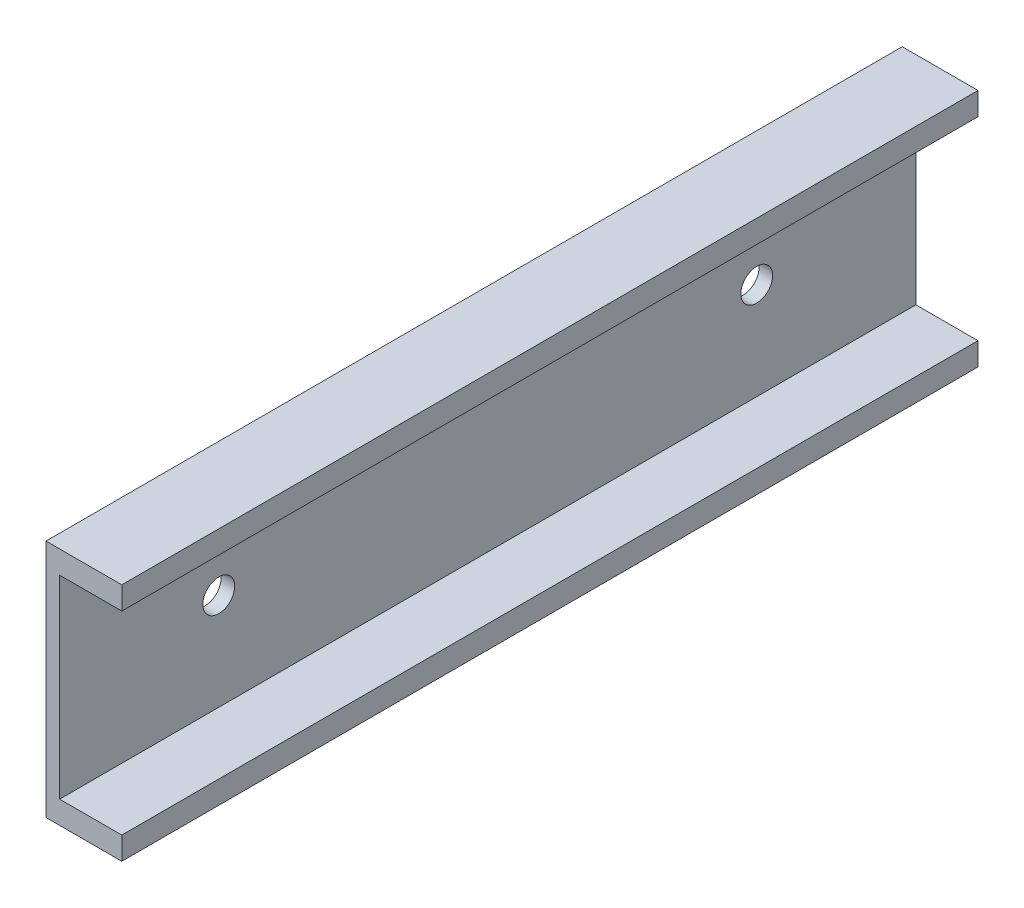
from build123d import *

# Parameters (mm, degrees)
EXTRUDE_1_DEPTH     = 56.5
SKETCH_2_R          = 1.05
CUT_EXTRUDE_1_DEPTH = 59.81071331


with BuildPart() as part:
    # Sketch 1 → Extrude 1 (new body)
    with BuildSketch(Plane.XY):
        Polygon((0, 15.8), (0, 0), (5, 0), (5, 1.5), (0.9, 1.5), (0.9, 14.3), (5, 14.3), (5, 15.8), align=None)
    extrude(amount=EXTRUDE_1_DEPTH)

    # Sketch 2 → Cut-Extrude 1 (cut, through all)
    with BuildSketch(Plane(origin=(0.9, 0, 0), x_dir=(0, 0, -1), z_dir=(1, 0, 0))):
        with Locations(Location((-46, 7.9, 0), (0, 0, 90))):
            Circle(SKETCH_2_R)
        with Locations(Location((-10.5, 7.9, 0), (0, 0, 90))):
            Circle(SKETCH_2_R)
    extrude(amount=-CUT_EXTRUDE_1_DEPTH, mode=Mode.SUBTRACT)


solid = part.part
